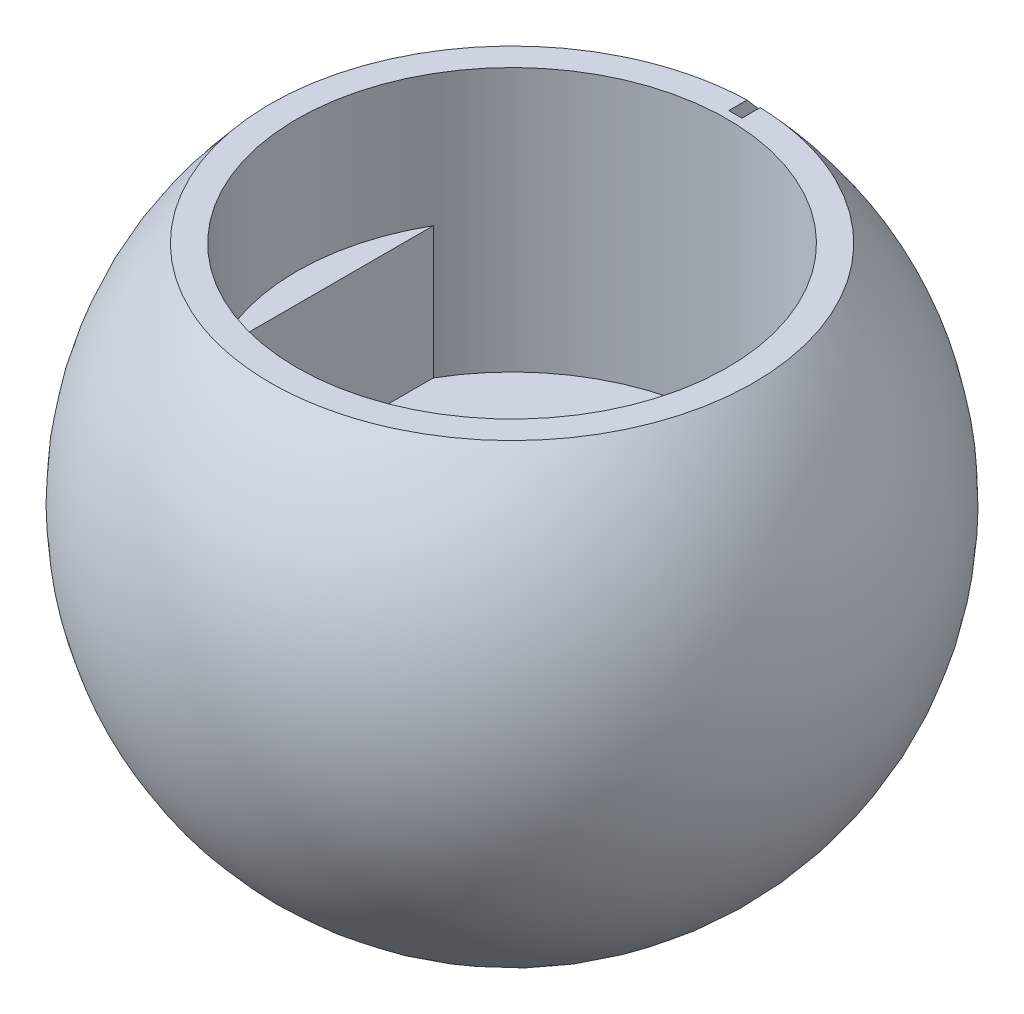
ISO-10303-21;
HEADER;
FILE_DESCRIPTION(('STEP AP214'),'2;1');
FILE_NAME('part.step','',(''),(''),'','','');
FILE_SCHEMA(('AUTOMOTIVE_DESIGN { 1 0 10303 214 1 1 1 1 }'));
ENDSEC;
DATA;
#1=APPLICATION_CONTEXT('core data for automotive mechanical design processes');
#2=APPLICATION_PROTOCOL_DEFINITION('international standard','automotive_design',2000,#1);
#3=PRODUCT_CONTEXT('',#1,'mechanical');
#4=PRODUCT('Part','Part','',(#3));
#5=PRODUCT_RELATED_PRODUCT_CATEGORY('part','',(#4));
#6=PRODUCT_DEFINITION_FORMATION('','',#4);
#7=PRODUCT_DEFINITION_CONTEXT('part definition',#1,'design');
#8=PRODUCT_DEFINITION('design','',#6,#7);
#9=PRODUCT_DEFINITION_SHAPE('','',#8);
#10=(LENGTH_UNIT() NAMED_UNIT(*) SI_UNIT(.MILLI.,.METRE.));
#11=(NAMED_UNIT(*) PLANE_ANGLE_UNIT() SI_UNIT($,.RADIAN.));
#12=(NAMED_UNIT(*) SI_UNIT($,.STERADIAN.) SOLID_ANGLE_UNIT());
#13=UNCERTAINTY_MEASURE_WITH_UNIT(LENGTH_MEASURE(1.E-05),#10,'distance_accuracy_value','');
#14=(GEOMETRIC_REPRESENTATION_CONTEXT(3) GLOBAL_UNCERTAINTY_ASSIGNED_CONTEXT((#13)) GLOBAL_UNIT_ASSIGNED_CONTEXT((#10,
#11,#12)) REPRESENTATION_CONTEXT('',''));
#15=CARTESIAN_POINT('',(0.,0.,0.));
#16=DIRECTION('',(0.,0.,1.));
#17=DIRECTION('',(1.,0.,0.));
#18=AXIS2_PLACEMENT_3D('',#15,#16,#17);
#19=CARTESIAN_POINT('',(0.,17.,0.));
#20=DIRECTION('',(0.,1.,0.));
#21=DIRECTION('',(0.,0.,1.));
#22=AXIS2_PLACEMENT_3D('',#19,#20,#21);
#23=PLANE('',#22);
#24=CARTESIAN_POINT('',(0.,17.,0.));
#25=DIRECTION('',(0.,1.,0.));
#26=DIRECTION('',(0.,0.,1.));
#27=AXIS2_PLACEMENT_3D('',#24,#25,#26);
#28=CIRCLE('',#27,16.3303027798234);
#29=CARTESIAN_POINT('',(0.,17.,16.3303027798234));
#30=VERTEX_POINT('',#29);
#31=EDGE_CURVE('E168',#30,#30,#28,.T.);
#32=ORIENTED_EDGE('',*,*,#31,.F.);
#33=EDGE_LOOP('',(#32));
#34=FACE_BOUND('',#33,.T.);
#35=CARTESIAN_POINT('',(0.,17.,0.));
#36=DIRECTION('',(0.,1.,0.));
#37=DIRECTION('',(0.,0.,1.));
#38=AXIS2_PLACEMENT_3D('',#35,#36,#37);
#39=CIRCLE('',#38,16.9410743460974);
#40=CARTESIAN_POINT('',(0.5,17.,-16.9336942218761));
#41=VERTEX_POINT('',#40);
#42=CARTESIAN_POINT('',(-0.5,17.,-16.9336942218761));
#43=VERTEX_POINT('',#42);
#44=EDGE_CURVE('E102',#41,#43,#39,.T.);
#45=ORIENTED_EDGE('',*,*,#44,.T.);
#46=DIRECTION('',(0.,0.,-1.));
#47=VECTOR('',#46,1.);
#48=CARTESIAN_POINT('',(-0.5,17.,0.));
#49=LINE('',#48,#47);
#50=CARTESIAN_POINT('',(-0.5,17.,-18.3234822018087));
#51=VERTEX_POINT('',#50);
#52=EDGE_CURVE('E112',#43,#51,#49,.T.);
#53=ORIENTED_EDGE('',*,*,#52,.T.);
#54=CARTESIAN_POINT('',(0.,17.,0.));
#55=DIRECTION('',(0.,1.,0.));
#56=DIRECTION('',(0.,0.,1.));
#57=AXIS2_PLACEMENT_3D('',#54,#55,#56);
#58=CIRCLE('',#57,18.3303027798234);
#59=CARTESIAN_POINT('',(0.5,17.,-18.3234822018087));
#60=VERTEX_POINT('',#59);
#61=EDGE_CURVE('E120',#60,#51,#58,.F.);
#62=ORIENTED_EDGE('',*,*,#61,.F.);
#63=DIRECTION('',(0.,0.,1.));
#64=VECTOR('',#63,1.);
#65=CARTESIAN_POINT('',(0.5,17.,0.));
#66=LINE('',#65,#64);
#67=EDGE_CURVE('E113',#60,#41,#66,.T.);
#68=ORIENTED_EDGE('',*,*,#67,.T.);
#69=EDGE_LOOP('',(#45,#53,#62,#68));
#70=FACE_BOUND('',#69,.T.);
#71=ADVANCED_FACE('F31',(#34,#70),#23,.T.);
#72=CARTESIAN_POINT('',(0.,0.,0.));
#73=DIRECTION('',(0.,0.,1.));
#74=DIRECTION('',(0.,1.,0.));
#75=AXIS2_PLACEMENT_3D('',#72,#73,#74);
#76=SPHERICAL_SURFACE('',#75,25.);
#77=ORIENTED_EDGE('',*,*,#61,.T.);
#78=CARTESIAN_POINT('',(-0.5,0.,0.));
#79=DIRECTION('',(-1.,0.,0.));
#80=DIRECTION('',(0.,0.,1.));
#81=AXIS2_PLACEMENT_3D('',#78,#79,#80);
#82=CIRCLE('',#81,24.9949994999);
#83=CARTESIAN_POINT('',(-0.5,-23.,-9.78519289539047));
#84=VERTEX_POINT('',#83);
#85=EDGE_CURVE('E121',#51,#84,#82,.T.);
#86=ORIENTED_EDGE('',*,*,#85,.T.);
#87=CARTESIAN_POINT('',(0.,-23.,0.));
#88=DIRECTION('',(0.,-1.,0.));
#89=DIRECTION('',(0.,0.,-1.));
#90=AXIS2_PLACEMENT_3D('',#87,#88,#89);
#91=CIRCLE('',#90,9.79795897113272);
#92=CARTESIAN_POINT('',(0.5,-23.,-9.78519289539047));
#93=VERTEX_POINT('',#92);
#94=EDGE_CURVE('E128',#93,#84,#91,.T.);
#95=ORIENTED_EDGE('',*,*,#94,.F.);
#96=CARTESIAN_POINT('',(0.5,0.,0.));
#97=DIRECTION('',(-1.,0.,0.));
#98=DIRECTION('',(0.,0.,1.));
#99=AXIS2_PLACEMENT_3D('',#96,#97,#98);
#100=CIRCLE('',#99,24.9949994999);
#101=EDGE_CURVE('E46',#60,#93,#100,.T.);
#102=ORIENTED_EDGE('',*,*,#101,.F.);
#103=EDGE_LOOP('',(#77,#86,#95,#102));
#104=FACE_BOUND('',#103,.T.);
#105=ADVANCED_FACE('F33',(#104),#76,.T.);
#106=CARTESIAN_POINT('',(0.,17.,0.));
#107=DIRECTION('',(0.,-1.,0.));
#108=DIRECTION('',(0.,0.,-1.));
#109=AXIS2_PLACEMENT_3D('',#106,#107,#108);
#110=CYLINDRICAL_SURFACE('',#109,9.79795897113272);
#111=CARTESIAN_POINT('',(0.,-3.,0.));
#112=DIRECTION('',(0.,1.,0.));
#113=DIRECTION('',(0.,0.,1.));
#114=AXIS2_PLACEMENT_3D('',#111,#112,#113);
#115=CIRCLE('',#114,9.79795897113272);
#116=CARTESIAN_POINT('',(0.,-3.,9.79795897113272));
#117=VERTEX_POINT('',#116);
#118=EDGE_CURVE('E131',#117,#117,#115,.T.);
#119=ORIENTED_EDGE('',*,*,#118,.T.);
#120=EDGE_LOOP('',(#119));
#121=FACE_BOUND('',#120,.T.);
#122=DIRECTION('',(0.,-1.,0.));
#123=VECTOR('',#122,1.);
#124=CARTESIAN_POINT('',(-0.5,17.,-9.78519289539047));
#125=LINE('',#124,#123);
#126=CARTESIAN_POINT('',(-0.5,-21.9089023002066,-9.78519289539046));
#127=VERTEX_POINT('',#126);
#128=EDGE_CURVE('E12',#127,#84,#125,.T.);
#129=ORIENTED_EDGE('',*,*,#128,.F.);
#130=CARTESIAN_POINT('',(0.,-21.9089023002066,0.));
#131=DIRECTION('',(0.,1.,0.));
#132=DIRECTION('',(0.,0.,1.));
#133=AXIS2_PLACEMENT_3D('',#130,#131,#132);
#134=CIRCLE('',#133,9.79795897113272);
#135=CARTESIAN_POINT('',(0.5,-21.9089023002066,-9.78519289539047));
#136=VERTEX_POINT('',#135);
#137=EDGE_CURVE('E39',#136,#127,#134,.T.);
#138=ORIENTED_EDGE('',*,*,#137,.F.);
#139=DIRECTION('',(0.,-1.,0.));
#140=VECTOR('',#139,1.);
#141=CARTESIAN_POINT('',(0.5,17.,-9.78519289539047));
#142=LINE('',#141,#140);
#143=EDGE_CURVE('E116',#93,#136,#142,.F.);
#144=ORIENTED_EDGE('',*,*,#143,.F.);
#145=ORIENTED_EDGE('',*,*,#94,.T.);
#146=EDGE_LOOP('',(#129,#138,#144,#145));
#147=FACE_BOUND('',#146,.T.);
#148=ADVANCED_FACE('F149',(#121,#147),#110,.F.);
#149=CARTESIAN_POINT('',(0.,7.,0.));
#150=DIRECTION('',(0.,1.,0.));
#151=DIRECTION('',(0.,0.,1.));
#152=AXIS2_PLACEMENT_3D('',#149,#150,#151);
#153=PLANE('',#152);
#154=DIRECTION('',(0.,0.,1.));
#155=VECTOR('',#154,1.);
#156=CARTESIAN_POINT('',(-14.1424570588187,7.,-8.16515138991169));
#157=LINE('',#156,#155);
#158=CARTESIAN_POINT('',(-14.1424570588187,7.,-8.16515138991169));
#159=VERTEX_POINT('',#158);
#160=CARTESIAN_POINT('',(-14.1424570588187,7.,8.16515138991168));
#161=VERTEX_POINT('',#160);
#162=EDGE_CURVE('E137',#159,#161,#157,.T.);
#163=ORIENTED_EDGE('',*,*,#162,.F.);
#164=CARTESIAN_POINT('',(0.,7.,0.));
#165=DIRECTION('',(0.,1.,0.));
#166=DIRECTION('',(0.,0.,1.));
#167=AXIS2_PLACEMENT_3D('',#164,#165,#166);
#168=CIRCLE('',#167,16.3303027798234);
#169=EDGE_CURVE('E162',#159,#161,#168,.T.);
#170=ORIENTED_EDGE('',*,*,#169,.T.);
#171=EDGE_LOOP('',(#163,#170));
#172=FACE_BOUND('',#171,.T.);
#173=ADVANCED_FACE('F219',(#172),#153,.T.);
#174=DIRECTION('',(0.866025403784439,0.,0.5));
#175=VECTOR('',#174,1.);
#176=CARTESIAN_POINT('',(-14.1424570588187,7.,8.16515138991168));
#177=LINE('',#176,#175);
#178=CARTESIAN_POINT('',(0.,7.,16.3303027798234));
#179=VERTEX_POINT('',#178);
#180=EDGE_CURVE('E134',#161,#179,#177,.T.);
#181=ORIENTED_EDGE('',*,*,#180,.F.);
#182=EDGE_CURVE('E165',#161,#179,#168,.T.);
#183=ORIENTED_EDGE('',*,*,#182,.T.);
#184=EDGE_LOOP('',(#181,#183));
#185=FACE_BOUND('',#184,.T.);
#186=ADVANCED_FACE('F300',(#185),#153,.T.);
#187=DIRECTION('',(0.866025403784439,0.,-0.5));
#188=VECTOR('',#187,1.);
#189=CARTESIAN_POINT('',(0.,7.,16.3303027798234));
#190=LINE('',#189,#188);
#191=CARTESIAN_POINT('',(14.1424570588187,7.,8.16515138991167));
#192=VERTEX_POINT('',#191);
#193=EDGE_CURVE('E54',#179,#192,#190,.T.);
#194=ORIENTED_EDGE('',*,*,#193,.F.);
#195=EDGE_CURVE('E152',#179,#192,#168,.T.);
#196=ORIENTED_EDGE('',*,*,#195,.T.);
#197=EDGE_LOOP('',(#194,#196));
#198=FACE_BOUND('',#197,.T.);
#199=ADVANCED_FACE('F213',(#198),#153,.T.);
#200=CARTESIAN_POINT('',(0.,7.,0.));
#201=DIRECTION('',(0.,1.,0.));
#202=DIRECTION('',(0.,0.,1.));
#203=AXIS2_PLACEMENT_3D('',#200,#201,#202);
#204=CYLINDRICAL_SURFACE('',#203,16.3303027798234);
#205=ORIENTED_EDGE('',*,*,#195,.F.);
#206=ORIENTED_EDGE('',*,*,#182,.F.);
#207=ORIENTED_EDGE('',*,*,#169,.F.);
#208=DIRECTION('',(0.,1.,0.));
#209=VECTOR('',#208,1.);
#210=CARTESIAN_POINT('',(-14.1424570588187,-3.,-8.16515138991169));
#211=LINE('',#210,#209);
#212=CARTESIAN_POINT('',(-14.1424570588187,-3.,-8.16515138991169));
#213=VERTEX_POINT('',#212);
#214=EDGE_CURVE('E179',#213,#159,#211,.T.);
#215=ORIENTED_EDGE('',*,*,#214,.F.);
#216=CARTESIAN_POINT('',(0.,-3.,0.));
#217=DIRECTION('',(0.,1.,0.));
#218=DIRECTION('',(0.,0.,1.));
#219=AXIS2_PLACEMENT_3D('',#216,#217,#218);
#220=CIRCLE('',#219,16.3303027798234);
#221=CARTESIAN_POINT('',(14.1424570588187,-3.,-8.16515138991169));
#222=VERTEX_POINT('',#221);
#223=EDGE_CURVE('E177',#222,#213,#220,.T.);
#224=ORIENTED_EDGE('',*,*,#223,.F.);
#225=DIRECTION('',(0.,1.,0.));
#226=VECTOR('',#225,1.);
#227=CARTESIAN_POINT('',(14.1424570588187,-3.,-8.16515138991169));
#228=LINE('',#227,#226);
#229=CARTESIAN_POINT('',(14.1424570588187,7.,-8.16515138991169));
#230=VERTEX_POINT('',#229);
#231=EDGE_CURVE('E169',#222,#230,#228,.T.);
#232=ORIENTED_EDGE('',*,*,#231,.T.);
#233=EDGE_CURVE('E155',#192,#230,#168,.T.);
#234=ORIENTED_EDGE('',*,*,#233,.F.);
#235=EDGE_LOOP('',(#205,#206,#207,#215,#224,#232,#234));
#236=FACE_BOUND('',#235,.T.);
#237=ORIENTED_EDGE('',*,*,#31,.T.);
#238=EDGE_LOOP('',(#237));
#239=FACE_BOUND('',#238,.T.);
#240=ADVANCED_FACE('F202',(#236,#239),#204,.F.);
#241=DIRECTION('',(0.,0.,-1.));
#242=VECTOR('',#241,1.);
#243=CARTESIAN_POINT('',(14.1424570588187,7.,8.16515138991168));
#244=LINE('',#243,#242);
#245=EDGE_CURVE('E174',#192,#230,#244,.T.);
#246=ORIENTED_EDGE('',*,*,#245,.F.);
#247=ORIENTED_EDGE('',*,*,#233,.T.);
#248=EDGE_LOOP('',(#246,#247));
#249=FACE_BOUND('',#248,.T.);
#250=ADVANCED_FACE('F212',(#249),#153,.T.);
#251=CARTESIAN_POINT('',(14.1424570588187,-3.,8.16515138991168));
#252=DIRECTION('',(1.,0.,0.));
#253=DIRECTION('',(0.,0.,-1.));
#254=AXIS2_PLACEMENT_3D('',#251,#252,#253);
#255=PLANE('',#254);
#256=ORIENTED_EDGE('',*,*,#245,.T.);
#257=ORIENTED_EDGE('',*,*,#231,.F.);
#258=DIRECTION('',(0.,0.,-1.));
#259=VECTOR('',#258,1.);
#260=CARTESIAN_POINT('',(14.1424570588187,-3.,8.16515138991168));
#261=LINE('',#260,#259);
#262=CARTESIAN_POINT('',(14.1424570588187,-3.,8.16515138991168));
#263=VERTEX_POINT('',#262);
#264=EDGE_CURVE('E181',#263,#222,#261,.T.);
#265=ORIENTED_EDGE('',*,*,#264,.F.);
#266=DIRECTION('',(0.,1.,0.));
#267=VECTOR('',#266,1.);
#268=CARTESIAN_POINT('',(14.1424570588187,-3.,8.16515138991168));
#269=LINE('',#268,#267);
#270=EDGE_CURVE('E171',#263,#192,#269,.T.);
#271=ORIENTED_EDGE('',*,*,#270,.T.);
#272=EDGE_LOOP('',(#256,#257,#265,#271));
#273=FACE_BOUND('',#272,.T.);
#274=ADVANCED_FACE('F217',(#273),#255,.F.);
#275=CARTESIAN_POINT('',(0.,-3.,16.3303027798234));
#276=DIRECTION('',(0.5,0.,0.866025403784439));
#277=DIRECTION('',(0.866025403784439,0.,-0.5));
#278=AXIS2_PLACEMENT_3D('',#275,#276,#277);
#279=PLANE('',#278);
#280=ORIENTED_EDGE('',*,*,#193,.T.);
#281=ORIENTED_EDGE('',*,*,#270,.F.);
#282=DIRECTION('',(0.866025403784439,0.,-0.5));
#283=VECTOR('',#282,1.);
#284=CARTESIAN_POINT('',(0.,-3.,16.3303027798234));
#285=LINE('',#284,#283);
#286=CARTESIAN_POINT('',(0.,-3.,16.3303027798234));
#287=VERTEX_POINT('',#286);
#288=EDGE_CURVE('E188',#287,#263,#285,.T.);
#289=ORIENTED_EDGE('',*,*,#288,.F.);
#290=DIRECTION('',(0.,1.,0.));
#291=VECTOR('',#290,1.);
#292=CARTESIAN_POINT('',(0.,-3.,16.3303027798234));
#293=LINE('',#292,#291);
#294=EDGE_CURVE('E185',#287,#179,#293,.T.);
#295=ORIENTED_EDGE('',*,*,#294,.T.);
#296=EDGE_LOOP('',(#280,#281,#289,#295));
#297=FACE_BOUND('',#296,.T.);
#298=ADVANCED_FACE('F227',(#297),#279,.F.);
#299=CARTESIAN_POINT('',(-14.1424570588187,-3.,8.16515138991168));
#300=DIRECTION('',(-0.5,0.,0.866025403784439));
#301=DIRECTION('',(0.866025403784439,0.,0.5));
#302=AXIS2_PLACEMENT_3D('',#299,#300,#301);
#303=PLANE('',#302);
#304=ORIENTED_EDGE('',*,*,#180,.T.);
#305=ORIENTED_EDGE('',*,*,#294,.F.);
#306=DIRECTION('',(0.866025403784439,0.,0.5));
#307=VECTOR('',#306,1.);
#308=CARTESIAN_POINT('',(-14.1424570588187,-3.,8.16515138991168));
#309=LINE('',#308,#307);
#310=CARTESIAN_POINT('',(-14.1424570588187,-3.,8.16515138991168));
#311=VERTEX_POINT('',#310);
#312=EDGE_CURVE('E194',#311,#287,#309,.T.);
#313=ORIENTED_EDGE('',*,*,#312,.F.);
#314=DIRECTION('',(0.,1.,0.));
#315=VECTOR('',#314,1.);
#316=CARTESIAN_POINT('',(-14.1424570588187,-3.,8.16515138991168));
#317=LINE('',#316,#315);
#318=EDGE_CURVE('E180',#311,#161,#317,.T.);
#319=ORIENTED_EDGE('',*,*,#318,.T.);
#320=EDGE_LOOP('',(#304,#305,#313,#319));
#321=FACE_BOUND('',#320,.T.);
#322=ADVANCED_FACE('F224',(#321),#303,.F.);
#323=CARTESIAN_POINT('',(-14.1424570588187,-3.,-8.16515138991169));
#324=DIRECTION('',(-1.,0.,0.));
#325=DIRECTION('',(0.,0.,1.));
#326=AXIS2_PLACEMENT_3D('',#323,#324,#325);
#327=PLANE('',#326);
#328=ORIENTED_EDGE('',*,*,#162,.T.);
#329=ORIENTED_EDGE('',*,*,#318,.F.);
#330=DIRECTION('',(0.,0.,1.));
#331=VECTOR('',#330,1.);
#332=CARTESIAN_POINT('',(-14.1424570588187,-3.,-8.16515138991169));
#333=LINE('',#332,#331);
#334=EDGE_CURVE('E328',#213,#311,#333,.T.);
#335=ORIENTED_EDGE('',*,*,#334,.F.);
#336=ORIENTED_EDGE('',*,*,#214,.T.);
#337=EDGE_LOOP('',(#328,#329,#335,#336));
#338=FACE_BOUND('',#337,.T.);
#339=ADVANCED_FACE('F220',(#338),#327,.F.);
#340=CARTESIAN_POINT('',(0.,-3.,0.));
#341=DIRECTION('',(0.,1.,0.));
#342=DIRECTION('',(0.,0.,1.));
#343=AXIS2_PLACEMENT_3D('',#340,#341,#342);
#344=PLANE('',#343);
#345=ORIENTED_EDGE('',*,*,#118,.F.);
#346=EDGE_LOOP('',(#345));
#347=FACE_BOUND('',#346,.T.);
#348=ORIENTED_EDGE('',*,*,#223,.T.);
#349=ORIENTED_EDGE('',*,*,#334,.T.);
#350=ORIENTED_EDGE('',*,*,#312,.T.);
#351=ORIENTED_EDGE('',*,*,#288,.T.);
#352=ORIENTED_EDGE('',*,*,#264,.T.);
#353=EDGE_LOOP('',(#348,#349,#350,#351,#352));
#354=FACE_BOUND('',#353,.T.);
#355=ADVANCED_FACE('F223',(#347,#354),#344,.T.);
#356=CARTESIAN_POINT('',(-0.5,24.9949994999,0.));
#357=DIRECTION('',(1.,0.,0.));
#358=DIRECTION('',(0.,0.,-1.));
#359=AXIS2_PLACEMENT_3D('',#356,#357,#358);
#360=PLANE('',#359);
#361=CARTESIAN_POINT('',(-0.5,0.,0.));
#362=DIRECTION('',(-1.,0.,0.));
#363=DIRECTION('',(0.,0.,1.));
#364=AXIS2_PLACEMENT_3D('',#361,#362,#363);
#365=CIRCLE('',#364,23.9947911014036);
#366=EDGE_CURVE('E108',#43,#127,#365,.T.);
#367=ORIENTED_EDGE('',*,*,#366,.T.);
#368=ORIENTED_EDGE('',*,*,#128,.T.);
#369=ORIENTED_EDGE('',*,*,#85,.F.);
#370=ORIENTED_EDGE('',*,*,#52,.F.);
#371=EDGE_LOOP('',(#367,#368,#369,#370));
#372=FACE_BOUND('',#371,.T.);
#373=ADVANCED_FACE('F148',(#372),#360,.T.);
#374=CARTESIAN_POINT('',(0.,0.,0.));
#375=DIRECTION('',(-1.,0.,0.));
#376=DIRECTION('',(0.,1.,0.));
#377=AXIS2_PLACEMENT_3D('',#374,#375,#376);
#378=SPHERICAL_SURFACE('',#377,24.);
#379=CARTESIAN_POINT('',(0.5,0.,0.));
#380=DIRECTION('',(-1.,0.,0.));
#381=DIRECTION('',(0.,0.,1.));
#382=AXIS2_PLACEMENT_3D('',#379,#380,#381);
#383=CIRCLE('',#382,23.9947911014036);
#384=EDGE_CURVE('E105',#41,#136,#383,.T.);
#385=ORIENTED_EDGE('',*,*,#384,.T.);
#386=ORIENTED_EDGE('',*,*,#137,.T.);
#387=ORIENTED_EDGE('',*,*,#366,.F.);
#388=ORIENTED_EDGE('',*,*,#44,.F.);
#389=EDGE_LOOP('',(#385,#386,#387,#388));
#390=FACE_BOUND('',#389,.T.);
#391=ADVANCED_FACE('F104',(#390),#378,.T.);
#392=CARTESIAN_POINT('',(0.5,24.9949994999,0.));
#393=DIRECTION('',(-1.,0.,0.));
#394=DIRECTION('',(0.,0.,1.));
#395=AXIS2_PLACEMENT_3D('',#392,#393,#394);
#396=PLANE('',#395);
#397=ORIENTED_EDGE('',*,*,#101,.T.);
#398=ORIENTED_EDGE('',*,*,#143,.T.);
#399=ORIENTED_EDGE('',*,*,#384,.F.);
#400=ORIENTED_EDGE('',*,*,#67,.F.);
#401=EDGE_LOOP('',(#397,#398,#399,#400));
#402=FACE_BOUND('',#401,.T.);
#403=ADVANCED_FACE('F115',(#402),#396,.T.);
#404=CLOSED_SHELL('',(#71,#105,#148,#173,#186,#199,#240,#250,#274,#298,#322,#339,#355,#373,#391,#403));
#405=MANIFOLD_SOLID_BREP('B2',#404);
#406=ADVANCED_BREP_SHAPE_REPRESENTATION('',(#18,#405),#14);
#407=SHAPE_DEFINITION_REPRESENTATION(#9,#406);
ENDSEC;
END-ISO-10303-21;
